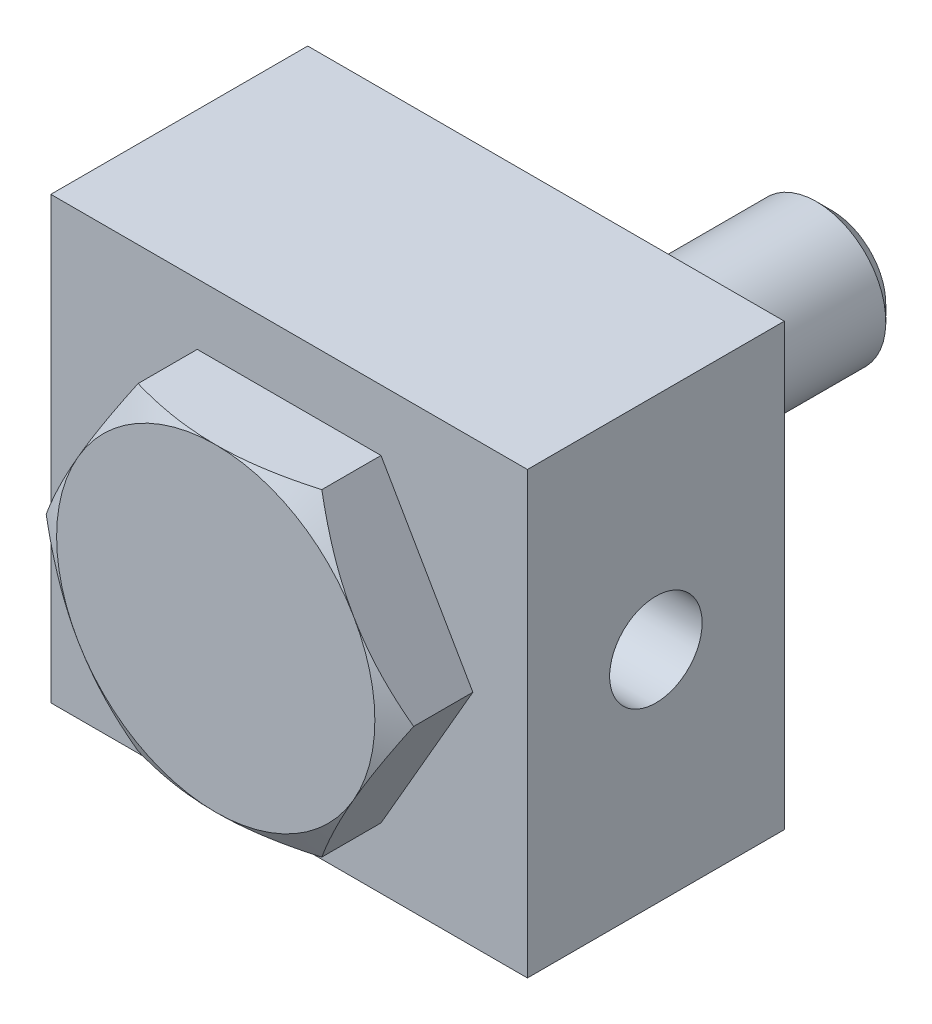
ISO-10303-21;
HEADER;
FILE_DESCRIPTION(('STEP AP214'),'2;1');
FILE_NAME('part.step','',(''),(''),'','','');
FILE_SCHEMA(('AUTOMOTIVE_DESIGN { 1 0 10303 214 1 1 1 1 }'));
ENDSEC;
DATA;
#1=APPLICATION_CONTEXT('core data for automotive mechanical design processes');
#2=APPLICATION_PROTOCOL_DEFINITION('international standard','automotive_design',2000,#1);
#3=PRODUCT_CONTEXT('',#1,'mechanical');
#4=PRODUCT('Part','Part','',(#3));
#5=PRODUCT_RELATED_PRODUCT_CATEGORY('part','',(#4));
#6=PRODUCT_DEFINITION_FORMATION('','',#4);
#7=PRODUCT_DEFINITION_CONTEXT('part definition',#1,'design');
#8=PRODUCT_DEFINITION('design','',#6,#7);
#9=PRODUCT_DEFINITION_SHAPE('','',#8);
#10=(LENGTH_UNIT() NAMED_UNIT(*) SI_UNIT(.MILLI.,.METRE.));
#11=(NAMED_UNIT(*) PLANE_ANGLE_UNIT() SI_UNIT($,.RADIAN.));
#12=(NAMED_UNIT(*) SI_UNIT($,.STERADIAN.) SOLID_ANGLE_UNIT());
#13=UNCERTAINTY_MEASURE_WITH_UNIT(LENGTH_MEASURE(1.E-05),#10,'distance_accuracy_value','');
#14=(GEOMETRIC_REPRESENTATION_CONTEXT(3) GLOBAL_UNCERTAINTY_ASSIGNED_CONTEXT((#13)) GLOBAL_UNIT_ASSIGNED_CONTEXT((#10,
#11,#12)) REPRESENTATION_CONTEXT('',''));
#15=CARTESIAN_POINT('',(0.,0.,0.));
#16=DIRECTION('',(0.,0.,1.));
#17=DIRECTION('',(1.,0.,0.));
#18=AXIS2_PLACEMENT_3D('',#15,#16,#17);
#19=CARTESIAN_POINT('',(-41.7703,41.7703,88.519));
#20=DIRECTION('',(0.,0.,1.));
#21=DIRECTION('',(0.,-1.,0.));
#22=AXIS2_PLACEMENT_3D('',#19,#20,#21);
#23=PLANE('',#22);
#24=CARTESIAN_POINT('',(0.,0.,88.519));
#25=DIRECTION('',(0.,0.,1.));
#26=DIRECTION('',(0.,-1.,0.));
#27=AXIS2_PLACEMENT_3D('',#24,#25,#26);
#28=CIRCLE('',#27,41.3);
#29=CARTESIAN_POINT('',(0.,-41.3,88.519));
#30=VERTEX_POINT('',#29);
#31=CARTESIAN_POINT('',(-35.7668491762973,-20.65,88.519));
#32=VERTEX_POINT('',#31);
#33=EDGE_CURVE('E113',#30,#32,#28,.F.);
#34=ORIENTED_EDGE('',*,*,#33,.F.);
#35=CARTESIAN_POINT('',(35.7668491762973,-20.65,88.519));
#36=VERTEX_POINT('',#35);
#37=EDGE_CURVE('E126',#36,#30,#28,.F.);
#38=ORIENTED_EDGE('',*,*,#37,.F.);
#39=CARTESIAN_POINT('',(35.7668491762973,20.65,88.519));
#40=VERTEX_POINT('',#39);
#41=EDGE_CURVE('E132',#40,#36,#28,.F.);
#42=ORIENTED_EDGE('',*,*,#41,.F.);
#43=CARTESIAN_POINT('',(0.,0.,88.519));
#44=DIRECTION('',(0.,0.,1.));
#45=DIRECTION('',(1.,0.,0.));
#46=AXIS2_PLACEMENT_3D('',#43,#44,#45);
#47=CIRCLE('',#46,41.3);
#48=CARTESIAN_POINT('',(0.,41.3,88.519));
#49=VERTEX_POINT('',#48);
#50=EDGE_CURVE('E364',#40,#49,#47,.T.);
#51=ORIENTED_EDGE('',*,*,#50,.T.);
#52=CARTESIAN_POINT('',(-35.7668491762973,20.65,88.519));
#53=VERTEX_POINT('',#52);
#54=EDGE_CURVE('E537',#53,#49,#28,.F.);
#55=ORIENTED_EDGE('',*,*,#54,.F.);
#56=EDGE_CURVE('E136',#32,#53,#28,.F.);
#57=ORIENTED_EDGE('',*,*,#56,.F.);
#58=EDGE_LOOP('',(#34,#38,#42,#51,#55,#57));
#59=FACE_BOUND('',#58,.T.);
#60=ADVANCED_FACE('F14',(#59),#23,.T.);
#61=CARTESIAN_POINT('',(0.,0.,78.8727471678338));
#62=DIRECTION('',(0.,0.,-1.));
#63=DIRECTION('',(-1.,0.,0.));
#64=AXIS2_PLACEMENT_3D('',#61,#62,#63);
#65=CONICAL_SURFACE('',#64,58.0078000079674,1.0471975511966);
#66=ORIENTED_EDGE('',*,*,#33,.T.);
#67=CARTESIAN_POINT('',(-23.8444506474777,-41.3002,84.8301661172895));
#68=CARTESIAN_POINT('',(-24.3685431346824,-40.3924451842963,85.1327273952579));
#69=CARTESIAN_POINT('',(-24.8946798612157,-39.4811496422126,85.4215586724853));
#70=CARTESIAN_POINT('',(-25.9511722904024,-37.6512510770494,85.967944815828));
#71=CARTESIAN_POINT('',(-26.4815293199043,-36.7326457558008,86.2254893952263));
#72=CARTESIAN_POINT('',(-27.5474986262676,-34.8863327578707,86.7058452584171));
#73=CARTESIAN_POINT('',(-28.0831203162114,-33.958608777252,86.9285735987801));
#74=CARTESIAN_POINT('',(-29.1580627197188,-32.0967539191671,87.3344988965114));
#75=CARTESIAN_POINT('',(-29.6973830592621,-31.1626236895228,87.5176997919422));
#76=CARTESIAN_POINT('',(-30.7659373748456,-29.3118333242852,87.8367936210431));
#77=CARTESIAN_POINT('',(-31.2950920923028,-28.3953104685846,87.973741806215));
#78=CARTESIAN_POINT('',(-32.3558261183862,-26.5580652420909,88.203371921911));
#79=CARTESIAN_POINT('',(-32.887405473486,-25.6373427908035,88.2960530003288));
#80=CARTESIAN_POINT('',(-33.9514570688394,-23.7943513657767,88.4348087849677));
#81=CARTESIAN_POINT('',(-34.4839274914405,-22.8720855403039,88.4809388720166));
#82=CARTESIAN_POINT('',(-35.5493597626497,-21.0267027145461,88.525600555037));
#83=CARTESIAN_POINT('',(-36.0823215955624,-20.1035857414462,88.524133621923));
#84=CARTESIAN_POINT('',(-37.0786961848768,-18.3778143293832,88.476926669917));
#85=CARTESIAN_POINT('',(-37.5421799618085,-17.5750368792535,88.4369431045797));
#86=CARTESIAN_POINT('',(-38.4680421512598,-15.9713965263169,88.3217374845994));
#87=CARTESIAN_POINT('',(-38.9304205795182,-15.1705335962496,88.2465159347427));
#88=CARTESIAN_POINT('',(-39.8538957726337,-13.571027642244,88.0621424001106));
#89=CARTESIAN_POINT('',(-40.3149909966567,-12.7723872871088,87.9529597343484));
#90=CARTESIAN_POINT('',(-41.2349897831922,-11.1789026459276,87.7025797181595));
#91=CARTESIAN_POINT('',(-41.6938933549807,-10.3840583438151,87.5613825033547));
#92=CARTESIAN_POINT('',(-42.6192515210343,-8.78129098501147,87.2457582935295));
#93=CARTESIAN_POINT('',(-43.0856491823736,-7.97346653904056,87.0706665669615));
#94=CARTESIAN_POINT('',(-44.0155899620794,-6.36276186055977,86.6919247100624));
#95=CARTESIAN_POINT('',(-44.4791326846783,-5.55988231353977,86.4882707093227));
#96=CARTESIAN_POINT('',(-45.4022766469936,-3.96095006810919,86.0554861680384));
#97=CARTESIAN_POINT('',(-45.8618837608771,-3.1648871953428,85.8264054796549));
#98=CARTESIAN_POINT('',(-46.7779191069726,-1.57826743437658,85.3450529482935));
#99=CARTESIAN_POINT('',(-47.2343481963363,-0.787709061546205,85.0927876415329));
#100=CARTESIAN_POINT('',(-47.689247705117,0.000199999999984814,84.8301661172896));
#101=B_SPLINE_CURVE_WITH_KNOTS('',3,(#67,#68,#69,#70,#71,#72,#73,#74,#75,#76,#77,#78,#79,#80,
#81,#82,#83,#84,#85,#86,#87,#88,#89,#90,#91,#92,#93,#94,#95,#96,#97,#98,#99,#100),.UNSPECIFIED.,
.F.,.F.,(4,2,2,2,2,2,2,2,2,2,2,2,2,2,2,2,4),(0.,3.27302247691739,6.54711819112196,
9.82889872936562,13.110352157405,16.3108811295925,19.5114717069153,22.7082500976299,
25.9049296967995,28.6877475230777,31.470525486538,34.2558247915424,37.0411122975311,
39.8878840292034,42.7350418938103,45.5767129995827,48.4175854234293),.UNSPECIFIED.);
#102=CARTESIAN_POINT('',(-23.8445661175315,-41.3,84.8302327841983));
#103=VERTEX_POINT('',#102);
#104=EDGE_CURVE('E116',#103,#32,#101,.T.);
#105=ORIENTED_EDGE('',*,*,#104,.F.);
#106=CARTESIAN_POINT('',(-64.0693641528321,-41.3,68.3538193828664));
#107=CARTESIAN_POINT('',(-63.1674107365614,-41.3,68.7914941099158));
#108=CARTESIAN_POINT('',(-62.264398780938,-41.3,69.2269946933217));
#109=CARTESIAN_POINT('',(-60.4560384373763,-41.3,70.0931399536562));
#110=CARTESIAN_POINT('',(-59.5506900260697,-41.3,70.5237845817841));
#111=CARTESIAN_POINT('',(-57.737315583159,-41.3,71.37976755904));
#112=CARTESIAN_POINT('',(-56.8292891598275,-41.3,71.8051050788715));
#113=CARTESIAN_POINT('',(-55.0104615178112,-41.3,72.6498031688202));
#114=CARTESIAN_POINT('',(-54.099660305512,-41.3,73.0691637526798));
#115=CARTESIAN_POINT('',(-52.2700525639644,-41.3,73.9034920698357));
#116=CARTESIAN_POINT('',(-51.3512294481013,-41.3,74.3184234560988));
#117=CARTESIAN_POINT('',(-49.5102220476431,-41.3,75.1407598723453));
#118=CARTESIAN_POINT('',(-48.5880377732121,-41.3,75.5481649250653));
#119=CARTESIAN_POINT('',(-46.7400185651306,-41.3,76.3545246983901));
#120=CARTESIAN_POINT('',(-45.8141837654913,-41.3,76.7534797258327));
#121=CARTESIAN_POINT('',(-43.9584905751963,-41.3,77.5419052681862));
#122=CARTESIAN_POINT('',(-43.0286322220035,-41.3,77.9313758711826));
#123=CARTESIAN_POINT('',(-41.1344932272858,-41.3,78.7120058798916));
#124=CARTESIAN_POINT('',(-40.1700683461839,-41.3,79.102815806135));
#125=CARTESIAN_POINT('',(-38.2360812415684,-41.3,79.8715362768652));
#126=CARTESIAN_POINT('',(-37.2665190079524,-41.3,80.2494467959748));
#127=CARTESIAN_POINT('',(-35.3216763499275,-41.3,80.9906628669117));
#128=CARTESIAN_POINT('',(-34.3463952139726,-41.3,81.3539665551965));
#129=CARTESIAN_POINT('',(-32.3897759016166,-41.3,82.0639044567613));
#130=CARTESIAN_POINT('',(-31.4084377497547,-41.3,82.4105387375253));
#131=CARTESIAN_POINT('',(-29.4412647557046,-41.3,83.0841522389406));
#132=CARTESIAN_POINT('',(-28.455443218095,-41.3,83.4111702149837));
#133=CARTESIAN_POINT('',(-26.4768978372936,-41.3,84.0437404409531));
#134=CARTESIAN_POINT('',(-25.4841738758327,-41.3,84.3492923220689));
#135=CARTESIAN_POINT('',(-23.4917994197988,-41.3,84.9359605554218));
#136=CARTESIAN_POINT('',(-22.4921508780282,-41.3,85.2170835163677));
#137=CARTESIAN_POINT('',(-20.4855307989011,-41.3,85.751821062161));
#138=CARTESIAN_POINT('',(-19.4785595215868,-41.3,86.0054366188));
#139=CARTESIAN_POINT('',(-17.4628765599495,-41.3,86.4804932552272));
#140=CARTESIAN_POINT('',(-16.4542050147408,-41.3,86.7021038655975));
#141=CARTESIAN_POINT('',(-14.4299865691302,-41.3,87.1113979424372));
#142=CARTESIAN_POINT('',(-13.414439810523,-41.3,87.2990821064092));
#143=CARTESIAN_POINT('',(-11.377162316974,-41.3,87.6372091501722));
#144=CARTESIAN_POINT('',(-10.3554317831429,-41.3,87.7876532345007));
#145=CARTESIAN_POINT('',(-8.30681732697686,-41.3,88.048308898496));
#146=CARTESIAN_POINT('',(-7.27993340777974,-41.3,88.1585205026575));
#147=CARTESIAN_POINT('',(-5.23591892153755,-41.3,88.3351296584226));
#148=CARTESIAN_POINT('',(-4.2188365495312,-41.3,88.4020816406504));
#149=CARTESIAN_POINT('',(-2.1827513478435,-41.3,88.4929124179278));
#150=CARTESIAN_POINT('',(-1.16374855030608,-41.3,88.5167919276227));
#151=CARTESIAN_POINT('',(0.874346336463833,-41.3,88.5209153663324));
#152=CARTESIAN_POINT('',(1.8934384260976,-41.3,88.5011590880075));
#153=CARTESIAN_POINT('',(3.92991883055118,-41.3,88.4184720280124));
#154=CARTESIAN_POINT('',(4.94730706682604,-41.3,88.3555393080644));
#155=CARTESIAN_POINT('',(6.67736113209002,-41.3,88.2128124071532));
#156=CARTESIAN_POINT('',(7.39091760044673,-41.3,88.1435535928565));
#157=CARTESIAN_POINT('',(8.81582940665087,-41.3,87.9851608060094));
#158=CARTESIAN_POINT('',(9.52718468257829,-41.3,87.8960262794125));
#159=CARTESIAN_POINT('',(11.657396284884,-41.3,87.6001099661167));
#160=CARTESIAN_POINT('',(13.072362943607,-41.3,87.364818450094));
#161=CARTESIAN_POINT('',(15.8902816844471,-41.3,86.8265351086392));
#162=CARTESIAN_POINT('',(17.2932234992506,-41.3,86.5234904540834));
#163=CARTESIAN_POINT('',(20.0850707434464,-41.3,85.8589608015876));
#164=CARTESIAN_POINT('',(21.4739763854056,-41.3,85.4974766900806));
#165=CARTESIAN_POINT('',(24.2681905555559,-41.3,84.7163388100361));
#166=CARTESIAN_POINT('',(25.6731880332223,-41.3,84.2955805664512));
#167=CARTESIAN_POINT('',(28.4693419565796,-41.3,83.4105802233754));
#168=CARTESIAN_POINT('',(29.8604983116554,-41.3,82.9463378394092));
#169=CARTESIAN_POINT('',(32.6296674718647,-41.3,81.9817397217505));
#170=CARTESIAN_POINT('',(34.0076844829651,-41.3,81.4813960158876));
#171=CARTESIAN_POINT('',(36.0661280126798,-41.3,80.7082102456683));
#172=CARTESIAN_POINT('',(36.7508455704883,-41.3,80.4467032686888));
#173=CARTESIAN_POINT('',(38.1176001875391,-41.3,79.9167638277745));
#174=CARTESIAN_POINT('',(38.7996372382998,-41.3,79.6483313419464));
#175=CARTESIAN_POINT('',(40.3980718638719,-41.3,79.0106346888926));
#176=CARTESIAN_POINT('',(41.3134382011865,-41.3,78.6387862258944));
#177=CARTESIAN_POINT('',(43.1399646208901,-41.3,77.8848826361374));
#178=CARTESIAN_POINT('',(44.0511246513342,-41.3,77.5028273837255));
#179=CARTESIAN_POINT('',(45.8696223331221,-41.3,76.7296224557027));
#180=CARTESIAN_POINT('',(46.7769598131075,-41.3,76.3384723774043));
#181=CARTESIAN_POINT('',(48.5881012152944,-41.3,75.5480693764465));
#182=CARTESIAN_POINT('',(49.4919051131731,-41.3,75.1488163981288));
#183=CARTESIAN_POINT('',(52.1988484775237,-41.3,73.9400545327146));
#184=CARTESIAN_POINT('',(53.9971500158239,-41.3,73.119700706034));
#185=CARTESIAN_POINT('',(57.5828931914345,-41.3,71.4557710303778));
#186=CARTESIAN_POINT('',(59.37033505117,-41.3,70.6121956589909));
#187=CARTESIAN_POINT('',(62.9380543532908,-41.3,68.9051912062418));
#188=CARTESIAN_POINT('',(64.7183220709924,-41.3,68.0417418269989));
#189=CARTESIAN_POINT('',(68.2711988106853,-41.3,66.2992324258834));
#190=CARTESIAN_POINT('',(70.0438078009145,-41.3,65.4201723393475));
#191=CARTESIAN_POINT('',(73.5823142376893,-41.3,63.6491967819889));
#192=CARTESIAN_POINT('',(75.3482124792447,-41.3,62.7572828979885));
#193=CARTESIAN_POINT('',(78.8744727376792,-41.3,60.9625944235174));
#194=CARTESIAN_POINT('',(80.6348347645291,-41.3,60.0598198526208));
#195=CARTESIAN_POINT('',(84.0054836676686,-41.3,58.3200977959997));
#196=CARTESIAN_POINT('',(85.6161465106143,-41.3,57.4838781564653));
#197=CARTESIAN_POINT('',(88.8339886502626,-41.3,55.8047663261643));
#198=CARTESIAN_POINT('',(90.4411679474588,-41.3,54.9618741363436));
#199=CARTESIAN_POINT('',(93.6525266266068,-41.3,53.2702676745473));
#200=CARTESIAN_POINT('',(95.2567059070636,-41.3,52.4215532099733));
#201=CARTESIAN_POINT('',(98.4623765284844,-41.3,50.7190626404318));
#202=CARTESIAN_POINT('',(100.063867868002,-41.3,49.8652865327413));
#203=CARTESIAN_POINT('',(103.260553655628,-41.3,48.1553865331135));
#204=CARTESIAN_POINT('',(104.855753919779,-41.3,47.2992735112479));
#205=CARTESIAN_POINT('',(108.044052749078,-41.3,45.5831423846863));
#206=CARTESIAN_POINT('',(109.637151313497,-41.3,44.7231242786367));
#207=CARTESIAN_POINT('',(112.821389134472,-41.3,42.9996744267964));
#208=CARTESIAN_POINT('',(114.412528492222,-41.3,42.1362428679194));
#209=CARTESIAN_POINT('',(117.593122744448,-41.3,40.4062884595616));
#210=CARTESIAN_POINT('',(119.182577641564,-41.3,39.539765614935));
#211=CARTESIAN_POINT('',(120.771287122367,-41.3,38.6718800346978));
#212=B_SPLINE_CURVE_WITH_KNOTS('',3,(#106,#107,#108,#109,#110,#111,#112,#113,#114,#115,#116,
#117,#118,#119,#120,#121,#122,#123,#124,#125,#126,#127,#128,#129,#130,#131,#132,#133,#134,#135,
#136,#137,#138,#139,#140,#141,#142,#143,#144,#145,#146,#147,#148,#149,#150,#151,#152,#153,#154,
#155,#156,#157,#158,#159,#160,#161,#162,#163,#164,#165,#166,#167,#168,#169,#170,#171,#172,#173,
#174,#175,#176,#177,#178,#179,#180,#181,#182,#183,#184,#185,#186,#187,#188,#189,#190,#191,#192,
#193,#194,#195,#196,#197,#198,#199,#200,#201,#202,#203,#204,#205,#206,#207,#208,#209,#210,#211),
.UNSPECIFIED.,.F.,.F.,(4,2,2,2,2,2,2,2,2,2,2,2,2,2,2,2,2,2,2,2,2,2,2,2,2,2,2,2,2,2,2,2,2,2,2,2,
2,2,2,2,2,2,2,2,2,2,2,2,2,2,2,2,4),(0.,3.00761084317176,6.01525188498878,9.02335716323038,
12.0314555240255,15.0559312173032,18.0803977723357,21.1047543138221,24.129082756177,
27.2507997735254,30.3725229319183,33.4946431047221,36.6167506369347,39.7324716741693,
42.8482462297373,45.963175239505,49.0779941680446,52.1756558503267,55.2732538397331,
58.3707516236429,61.4682475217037,64.5252131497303,67.5821280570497,70.63905748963,
73.6961241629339,75.8465795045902,77.9970947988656,82.2982319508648,86.6027345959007,
90.9071719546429,95.3062764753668,99.7054097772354,104.103084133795,106.301921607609,
108.500766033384,111.464728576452,114.428727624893,117.392858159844,120.357009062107,
126.286516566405,132.215902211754,138.151638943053,144.087400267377,150.022434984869,
155.957459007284,161.401840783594,166.846221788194,172.290783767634,177.735348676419,
183.166580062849,188.597813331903,194.028753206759,199.459684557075),.UNSPECIFIED.);
#213=EDGE_CURVE('E109',#30,#103,#212,.F.);
#214=ORIENTED_EDGE('',*,*,#213,.F.);
#215=EDGE_LOOP('',(#66,#105,#214));
#216=FACE_BOUND('',#215,.T.);
#217=ADVANCED_FACE('F111',(#216),#65,.T.);
#218=CARTESIAN_POINT('',(47.6892477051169,0.000200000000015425,84.8301661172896));
#219=CARTESIAN_POINT('',(47.1651552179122,-0.907554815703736,85.1327273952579));
#220=CARTESIAN_POINT('',(46.6390184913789,-1.8188503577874,85.4215586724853));
#221=CARTESIAN_POINT('',(45.5825260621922,-3.64874892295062,85.967944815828));
#222=CARTESIAN_POINT('',(45.0521690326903,-4.56735424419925,86.2254893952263));
#223=CARTESIAN_POINT('',(43.986199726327,-6.41366724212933,86.7058452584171));
#224=CARTESIAN_POINT('',(43.4505780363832,-7.34139122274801,86.9285735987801));
#225=CARTESIAN_POINT('',(42.3756356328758,-9.2032460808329,87.3344988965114));
#226=CARTESIAN_POINT('',(41.8363152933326,-10.1373763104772,87.5176997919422));
#227=CARTESIAN_POINT('',(40.767760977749,-11.9881666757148,87.8367936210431));
#228=CARTESIAN_POINT('',(40.2386062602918,-12.9046895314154,87.973741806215));
#229=CARTESIAN_POINT('',(39.1778722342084,-14.7419347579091,88.203371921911));
#230=CARTESIAN_POINT('',(38.6462928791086,-15.6626572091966,88.2960530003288));
#231=CARTESIAN_POINT('',(37.5822412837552,-17.5056486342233,88.4348087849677));
#232=CARTESIAN_POINT('',(37.0497708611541,-18.4279144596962,88.4809388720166));
#233=CARTESIAN_POINT('',(35.984338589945,-20.2732972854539,88.525600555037));
#234=CARTESIAN_POINT('',(35.4513767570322,-21.1964142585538,88.524133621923));
#235=CARTESIAN_POINT('',(34.4550021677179,-22.9221856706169,88.476926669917));
#236=CARTESIAN_POINT('',(33.9915183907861,-23.7249631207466,88.4369431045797));
#237=CARTESIAN_POINT('',(33.0656562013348,-25.3286034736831,88.3217374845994));
#238=CARTESIAN_POINT('',(32.6032777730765,-26.1294664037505,88.2465159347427));
#239=CARTESIAN_POINT('',(31.679802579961,-27.728972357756,88.0621424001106));
#240=CARTESIAN_POINT('',(31.218707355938,-28.5276127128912,87.9529597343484));
#241=CARTESIAN_POINT('',(30.2987085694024,-30.1210973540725,87.7025797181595));
#242=CARTESIAN_POINT('',(29.8398049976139,-30.915941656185,87.5613825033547));
#243=CARTESIAN_POINT('',(28.9144468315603,-32.5187090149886,87.2457582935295));
#244=CARTESIAN_POINT('',(28.4480491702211,-33.3265334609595,87.0706665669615));
#245=CARTESIAN_POINT('',(27.5181083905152,-34.9372381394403,86.6919247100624));
#246=CARTESIAN_POINT('',(27.0545656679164,-35.7401176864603,86.4882707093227));
#247=CARTESIAN_POINT('',(26.131421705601,-37.3390499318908,86.0554861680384));
#248=CARTESIAN_POINT('',(25.6718145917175,-38.1351128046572,85.8264054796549));
#249=CARTESIAN_POINT('',(24.7557792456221,-39.7217325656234,85.3450529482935));
#250=CARTESIAN_POINT('',(24.2993501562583,-40.5122909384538,85.0927876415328));
#251=CARTESIAN_POINT('',(23.8444506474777,-41.3002,84.8301661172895));
#252=B_SPLINE_CURVE_WITH_KNOTS('',3,(#218,#219,#220,#221,#222,#223,#224,#225,#226,#227,#228,
#229,#230,#231,#232,#233,#234,#235,#236,#237,#238,#239,#240,#241,#242,#243,#244,#245,#246,#247,
#248,#249,#250,#251),.UNSPECIFIED.,.F.,.F.,(4,2,2,2,2,2,2,2,2,2,2,2,2,2,2,2,4),(0.,
3.27302247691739,6.54711819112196,9.82889872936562,13.110352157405,16.3108811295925,
19.5114717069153,22.7082500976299,25.9049296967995,28.6877475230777,31.470525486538,
34.2558247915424,37.0411122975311,39.8878840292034,42.7350418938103,45.5767129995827,
48.4175854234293),.UNSPECIFIED.);
#253=CARTESIAN_POINT('',(23.8445661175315,-41.3,84.8302327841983));
#254=VERTEX_POINT('',#253);
#255=EDGE_CURVE('E121',#36,#254,#252,.T.);
#256=ORIENTED_EDGE('',*,*,#255,.F.);
#257=ORIENTED_EDGE('',*,*,#37,.T.);
#258=EDGE_CURVE('E120',#254,#30,#212,.F.);
#259=ORIENTED_EDGE('',*,*,#258,.F.);
#260=EDGE_LOOP('',(#256,#257,#259));
#261=FACE_BOUND('',#260,.T.);
#262=ADVANCED_FACE('F127',(#261),#65,.T.);
#263=CARTESIAN_POINT('',(23.8444506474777,41.3002,84.8301661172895));
#264=CARTESIAN_POINT('',(24.3685431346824,40.3924451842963,85.1327273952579));
#265=CARTESIAN_POINT('',(24.8946798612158,39.4811496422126,85.4215586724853));
#266=CARTESIAN_POINT('',(25.9511722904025,37.6512510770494,85.967944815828));
#267=CARTESIAN_POINT('',(26.4815293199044,36.7326457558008,86.2254893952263));
#268=CARTESIAN_POINT('',(27.5474986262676,34.8863327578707,86.7058452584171));
#269=CARTESIAN_POINT('',(28.0831203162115,33.958608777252,86.9285735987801));
#270=CARTESIAN_POINT('',(29.1580627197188,32.0967539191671,87.3344988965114));
#271=CARTESIAN_POINT('',(29.6973830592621,31.1626236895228,87.5176997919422));
#272=CARTESIAN_POINT('',(30.7659373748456,29.3118333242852,87.8367936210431));
#273=CARTESIAN_POINT('',(31.2950920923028,28.3953104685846,87.973741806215));
#274=CARTESIAN_POINT('',(32.3558261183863,26.5580652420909,88.203371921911));
#275=CARTESIAN_POINT('',(32.887405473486,25.6373427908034,88.2960530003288));
#276=CARTESIAN_POINT('',(33.9514570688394,23.7943513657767,88.4348087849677));
#277=CARTESIAN_POINT('',(34.4839274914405,22.8720855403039,88.4809388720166));
#278=CARTESIAN_POINT('',(35.5493597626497,21.0267027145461,88.525600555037));
#279=CARTESIAN_POINT('',(36.0823215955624,20.1035857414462,88.524133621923));
#280=CARTESIAN_POINT('',(37.0786961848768,18.3778143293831,88.476926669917));
#281=CARTESIAN_POINT('',(37.5421799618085,17.5750368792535,88.4369431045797));
#282=CARTESIAN_POINT('',(38.4680421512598,15.9713965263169,88.3217374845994));
#283=CARTESIAN_POINT('',(38.9304205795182,15.1705335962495,88.2465159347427));
#284=CARTESIAN_POINT('',(39.8538957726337,13.571027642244,88.0621424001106));
#285=CARTESIAN_POINT('',(40.3149909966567,12.7723872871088,87.9529597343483));
#286=CARTESIAN_POINT('',(41.2349897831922,11.1789026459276,87.7025797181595));
#287=CARTESIAN_POINT('',(41.6938933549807,10.3840583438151,87.5613825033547));
#288=CARTESIAN_POINT('',(42.6192515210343,8.78129098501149,87.2457582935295));
#289=CARTESIAN_POINT('',(43.0856491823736,7.97346653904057,87.0706665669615));
#290=CARTESIAN_POINT('',(44.0155899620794,6.36276186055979,86.6919247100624));
#291=CARTESIAN_POINT('',(44.4791326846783,5.55988231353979,86.4882707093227));
#292=CARTESIAN_POINT('',(45.4022766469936,3.96095006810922,86.0554861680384));
#293=CARTESIAN_POINT('',(45.8618837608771,3.16488719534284,85.8264054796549));
#294=CARTESIAN_POINT('',(46.7779191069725,1.57826743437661,85.3450529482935));
#295=CARTESIAN_POINT('',(47.2343481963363,0.787709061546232,85.0927876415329));
#296=CARTESIAN_POINT('',(47.6892477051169,-0.000199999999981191,84.8301661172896));
#297=B_SPLINE_CURVE_WITH_KNOTS('',3,(#263,#264,#265,#266,#267,#268,#269,#270,#271,#272,#273,
#274,#275,#276,#277,#278,#279,#280,#281,#282,#283,#284,#285,#286,#287,#288,#289,#290,#291,#292,
#293,#294,#295,#296),.UNSPECIFIED.,.F.,.F.,(4,2,2,2,2,2,2,2,2,2,2,2,2,2,2,2,4),(0.,
3.27302247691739,6.54711819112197,9.82889872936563,13.110352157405,16.3108811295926,
19.5114717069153,22.70825009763,25.9049296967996,28.6877475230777,31.470525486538,
34.2558247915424,37.0411122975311,39.8878840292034,42.7350418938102,45.5767129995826,
48.4175854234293),.UNSPECIFIED.);
#298=CARTESIAN_POINT('',(47.6891322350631,0.,84.8302327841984));
#299=VERTEX_POINT('',#298);
#300=EDGE_CURVE('E202',#40,#299,#297,.T.);
#301=ORIENTED_EDGE('',*,*,#300,.F.);
#302=ORIENTED_EDGE('',*,*,#41,.T.);
#303=EDGE_CURVE('E197',#299,#36,#252,.T.);
#304=ORIENTED_EDGE('',*,*,#303,.F.);
#305=EDGE_LOOP('',(#301,#302,#304));
#306=FACE_BOUND('',#305,.T.);
#307=ADVANCED_FACE('F497',(#306),#65,.T.);
#308=CARTESIAN_POINT('',(-64.0693641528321,41.3,68.3538193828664));
#309=CARTESIAN_POINT('',(-63.1674107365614,41.3,68.7914941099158));
#310=CARTESIAN_POINT('',(-62.264398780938,41.3,69.2269946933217));
#311=CARTESIAN_POINT('',(-60.4560384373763,41.3,70.0931399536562));
#312=CARTESIAN_POINT('',(-59.5506900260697,41.3,70.5237845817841));
#313=CARTESIAN_POINT('',(-57.737315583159,41.3,71.37976755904));
#314=CARTESIAN_POINT('',(-56.8292891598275,41.3,71.8051050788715));
#315=CARTESIAN_POINT('',(-55.0104615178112,41.3,72.6498031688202));
#316=CARTESIAN_POINT('',(-54.099660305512,41.3,73.0691637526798));
#317=CARTESIAN_POINT('',(-52.2700525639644,41.3,73.9034920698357));
#318=CARTESIAN_POINT('',(-51.3512294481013,41.3,74.3184234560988));
#319=CARTESIAN_POINT('',(-49.5102220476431,41.3,75.1407598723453));
#320=CARTESIAN_POINT('',(-48.5880377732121,41.3,75.5481649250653));
#321=CARTESIAN_POINT('',(-46.7400185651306,41.3,76.35452469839));
#322=CARTESIAN_POINT('',(-45.8141837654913,41.3,76.7534797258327));
#323=CARTESIAN_POINT('',(-43.9584905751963,41.3,77.5419052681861));
#324=CARTESIAN_POINT('',(-43.0286322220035,41.3,77.9313758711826));
#325=CARTESIAN_POINT('',(-41.1344932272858,41.3,78.7120058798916));
#326=CARTESIAN_POINT('',(-40.1700683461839,41.3,79.102815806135));
#327=CARTESIAN_POINT('',(-38.2360812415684,41.3,79.8715362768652));
#328=CARTESIAN_POINT('',(-37.2665190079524,41.3,80.2494467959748));
#329=CARTESIAN_POINT('',(-35.3216763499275,41.3,80.9906628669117));
#330=CARTESIAN_POINT('',(-34.3463952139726,41.3,81.3539665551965));
#331=CARTESIAN_POINT('',(-32.3897759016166,41.3,82.0639044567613));
#332=CARTESIAN_POINT('',(-31.4084377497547,41.3,82.4105387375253));
#333=CARTESIAN_POINT('',(-29.4412647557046,41.3,83.0841522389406));
#334=CARTESIAN_POINT('',(-28.455443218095,41.3,83.4111702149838));
#335=CARTESIAN_POINT('',(-26.4768978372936,41.3,84.0437404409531));
#336=CARTESIAN_POINT('',(-25.4841738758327,41.3,84.3492923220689));
#337=CARTESIAN_POINT('',(-23.4917994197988,41.3,84.9359605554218));
#338=CARTESIAN_POINT('',(-22.4921508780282,41.3,85.2170835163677));
#339=CARTESIAN_POINT('',(-20.4855307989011,41.3,85.751821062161));
#340=CARTESIAN_POINT('',(-19.4785595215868,41.3,86.0054366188));
#341=CARTESIAN_POINT('',(-17.4628765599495,41.3,86.4804932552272));
#342=CARTESIAN_POINT('',(-16.4542050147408,41.3,86.7021038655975));
#343=CARTESIAN_POINT('',(-14.4299865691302,41.3,87.1113979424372));
#344=CARTESIAN_POINT('',(-13.414439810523,41.3,87.2990821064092));
#345=CARTESIAN_POINT('',(-11.377162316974,41.3,87.6372091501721));
#346=CARTESIAN_POINT('',(-10.355431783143,41.3,87.7876532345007));
#347=CARTESIAN_POINT('',(-8.30681732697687,41.3,88.048308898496));
#348=CARTESIAN_POINT('',(-7.27993340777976,41.3,88.1585205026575));
#349=CARTESIAN_POINT('',(-5.23591892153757,41.3,88.3351296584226));
#350=CARTESIAN_POINT('',(-4.21883654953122,41.3,88.4020816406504));
#351=CARTESIAN_POINT('',(-2.18275134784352,41.3,88.4929124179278));
#352=CARTESIAN_POINT('',(-1.16374855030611,41.3,88.5167919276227));
#353=CARTESIAN_POINT('',(0.874346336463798,41.3,88.5209153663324));
#354=CARTESIAN_POINT('',(1.89343842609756,41.3,88.5011590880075));
#355=CARTESIAN_POINT('',(3.92991883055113,41.3,88.4184720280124));
#356=CARTESIAN_POINT('',(4.947307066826,41.3,88.3555393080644));
#357=CARTESIAN_POINT('',(6.67736113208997,41.3,88.2128124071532));
#358=CARTESIAN_POINT('',(7.39091760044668,41.3,88.1435535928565));
#359=CARTESIAN_POINT('',(8.81582940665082,41.3,87.9851608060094));
#360=CARTESIAN_POINT('',(9.52718468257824,41.3,87.8960262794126));
#361=CARTESIAN_POINT('',(11.6573962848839,41.3,87.6001099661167));
#362=CARTESIAN_POINT('',(13.072362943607,41.3,87.364818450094));
#363=CARTESIAN_POINT('',(15.890281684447,41.3,86.8265351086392));
#364=CARTESIAN_POINT('',(17.2932234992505,41.3,86.5234904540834));
#365=CARTESIAN_POINT('',(20.0850707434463,41.3,85.8589608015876));
#366=CARTESIAN_POINT('',(21.4739763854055,41.3,85.4974766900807));
#367=CARTESIAN_POINT('',(24.2681905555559,41.3,84.7163388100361));
#368=CARTESIAN_POINT('',(25.6731880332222,41.3,84.2955805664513));
#369=CARTESIAN_POINT('',(28.4693419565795,41.3,83.4105802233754));
#370=CARTESIAN_POINT('',(29.8604983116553,41.3,82.9463378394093));
#371=CARTESIAN_POINT('',(32.6296674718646,41.3,81.9817397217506));
#372=CARTESIAN_POINT('',(34.007684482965,41.3,81.4813960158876));
#373=CARTESIAN_POINT('',(36.0661280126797,41.3,80.7082102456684));
#374=CARTESIAN_POINT('',(36.7508455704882,41.3,80.4467032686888));
#375=CARTESIAN_POINT('',(38.117600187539,41.3,79.9167638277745));
#376=CARTESIAN_POINT('',(38.7996372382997,41.3,79.6483313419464));
#377=CARTESIAN_POINT('',(40.3980718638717,41.3,79.0106346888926));
#378=CARTESIAN_POINT('',(41.3134382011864,41.3,78.6387862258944));
#379=CARTESIAN_POINT('',(43.13996462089,41.3,77.8848826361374));
#380=CARTESIAN_POINT('',(44.0511246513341,41.3,77.5028273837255));
#381=CARTESIAN_POINT('',(45.869622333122,41.3,76.7296224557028));
#382=CARTESIAN_POINT('',(46.7769598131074,41.3,76.3384723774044));
#383=CARTESIAN_POINT('',(48.5881012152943,41.3,75.5480693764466));
#384=CARTESIAN_POINT('',(49.491905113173,41.3,75.1488163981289));
#385=CARTESIAN_POINT('',(52.1988484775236,41.3,73.9400545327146));
#386=CARTESIAN_POINT('',(53.9971500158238,41.3,73.119700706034));
#387=CARTESIAN_POINT('',(57.5828931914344,41.3,71.4557710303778));
#388=CARTESIAN_POINT('',(59.3703350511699,41.3,70.612195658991));
#389=CARTESIAN_POINT('',(62.9380543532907,41.3,68.9051912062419));
#390=CARTESIAN_POINT('',(64.7183220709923,41.3,68.0417418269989));
#391=CARTESIAN_POINT('',(68.2711988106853,41.3,66.2992324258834));
#392=CARTESIAN_POINT('',(70.0438078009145,41.3,65.4201723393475));
#393=CARTESIAN_POINT('',(73.5823142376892,41.3,63.649196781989));
#394=CARTESIAN_POINT('',(75.3482124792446,41.3,62.7572828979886));
#395=CARTESIAN_POINT('',(78.8744727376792,41.3,60.9625944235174));
#396=CARTESIAN_POINT('',(80.634834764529,41.3,60.0598198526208));
#397=CARTESIAN_POINT('',(84.0054836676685,41.3,58.3200977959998));
#398=CARTESIAN_POINT('',(85.6161465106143,41.3,57.4838781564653));
#399=CARTESIAN_POINT('',(88.8339886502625,41.3,55.8047663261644));
#400=CARTESIAN_POINT('',(90.4411679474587,41.3,54.9618741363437));
#401=CARTESIAN_POINT('',(93.6525266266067,41.3,53.2702676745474));
#402=CARTESIAN_POINT('',(95.2567059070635,41.3,52.4215532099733));
#403=CARTESIAN_POINT('',(98.4623765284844,41.3,50.7190626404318));
#404=CARTESIAN_POINT('',(100.063867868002,41.3,49.8652865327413));
#405=CARTESIAN_POINT('',(103.260553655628,41.3,48.1553865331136));
#406=CARTESIAN_POINT('',(104.855753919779,41.3,47.299273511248));
#407=CARTESIAN_POINT('',(108.044052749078,41.3,45.5831423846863));
#408=CARTESIAN_POINT('',(109.637151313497,41.3,44.7231242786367));
#409=CARTESIAN_POINT('',(112.821389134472,41.3,42.9996744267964));
#410=CARTESIAN_POINT('',(114.412528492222,41.3,42.1362428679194));
#411=CARTESIAN_POINT('',(117.593122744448,41.3,40.4062884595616));
#412=CARTESIAN_POINT('',(119.182577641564,41.3,39.539765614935));
#413=CARTESIAN_POINT('',(120.771287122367,41.3,38.6718800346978));
#414=B_SPLINE_CURVE_WITH_KNOTS('',3,(#308,#309,#310,#311,#312,#313,#314,#315,#316,#317,#318,
#319,#320,#321,#322,#323,#324,#325,#326,#327,#328,#329,#330,#331,#332,#333,#334,#335,#336,#337,
#338,#339,#340,#341,#342,#343,#344,#345,#346,#347,#348,#349,#350,#351,#352,#353,#354,#355,#356,
#357,#358,#359,#360,#361,#362,#363,#364,#365,#366,#367,#368,#369,#370,#371,#372,#373,#374,#375,
#376,#377,#378,#379,#380,#381,#382,#383,#384,#385,#386,#387,#388,#389,#390,#391,#392,#393,#394,
#395,#396,#397,#398,#399,#400,#401,#402,#403,#404,#405,#406,#407,#408,#409,#410,#411,#412,#413),
.UNSPECIFIED.,.F.,.F.,(4,2,2,2,2,2,2,2,2,2,2,2,2,2,2,2,2,2,2,2,2,2,2,2,2,2,2,2,2,2,2,2,2,2,2,2,
2,2,2,2,2,2,2,2,2,2,2,2,2,2,2,2,4),(0.,3.00761084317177,6.01525188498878,9.02335716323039,
12.0314555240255,15.0559312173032,18.0803977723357,21.1047543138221,24.129082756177,
27.2507997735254,30.3725229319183,33.4946431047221,36.6167506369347,39.7324716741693,
42.8482462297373,45.9631752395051,49.0779941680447,52.1756558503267,55.2732538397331,
58.3707516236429,61.4682475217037,64.5252131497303,67.5821280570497,70.63905748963,
73.6961241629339,75.8465795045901,77.9970947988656,82.2982319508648,86.6027345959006,
90.9071719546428,95.3062764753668,99.7054097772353,104.103084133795,106.301921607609,
108.500766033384,111.464728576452,114.428727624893,117.392858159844,120.357009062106,
126.286516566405,132.215902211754,138.151638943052,144.087400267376,150.022434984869,
155.957459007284,161.401840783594,166.846221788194,172.290783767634,177.735348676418,
183.166580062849,188.597813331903,194.028753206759,199.459684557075),.UNSPECIFIED.);
#415=CARTESIAN_POINT('',(23.8445661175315,41.3,84.8302327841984));
#416=VERTEX_POINT('',#415);
#417=EDGE_CURVE('E340',#49,#416,#414,.T.);
#418=ORIENTED_EDGE('',*,*,#417,.F.);
#419=ORIENTED_EDGE('',*,*,#50,.F.);
#420=EDGE_CURVE('E191',#416,#40,#297,.T.);
#421=ORIENTED_EDGE('',*,*,#420,.F.);
#422=EDGE_LOOP('',(#418,#419,#421));
#423=FACE_BOUND('',#422,.T.);
#424=ADVANCED_FACE('F503',(#423),#65,.T.);
#425=ORIENTED_EDGE('',*,*,#54,.T.);
#426=CARTESIAN_POINT('',(-23.8445661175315,41.3,84.8302327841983));
#427=VERTEX_POINT('',#426);
#428=EDGE_CURVE('E363',#427,#49,#414,.T.);
#429=ORIENTED_EDGE('',*,*,#428,.F.);
#430=CARTESIAN_POINT('',(-47.689247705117,-0.00020000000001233,84.8301661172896));
#431=CARTESIAN_POINT('',(-47.1651552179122,0.907554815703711,85.1327273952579));
#432=CARTESIAN_POINT('',(-46.6390184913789,1.81885035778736,85.4215586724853));
#433=CARTESIAN_POINT('',(-45.5825260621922,3.64874892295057,85.967944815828));
#434=CARTESIAN_POINT('',(-45.0521690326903,4.56735424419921,86.2254893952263));
#435=CARTESIAN_POINT('',(-43.9861997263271,6.41366724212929,86.7058452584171));
#436=CARTESIAN_POINT('',(-43.4505780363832,7.34139122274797,86.9285735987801));
#437=CARTESIAN_POINT('',(-42.3756356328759,9.20324608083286,87.3344988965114));
#438=CARTESIAN_POINT('',(-41.8363152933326,10.1373763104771,87.5176997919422));
#439=CARTESIAN_POINT('',(-40.7677609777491,11.9881666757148,87.8367936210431));
#440=CARTESIAN_POINT('',(-40.2386062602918,12.9046895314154,87.973741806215));
#441=CARTESIAN_POINT('',(-39.1778722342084,14.7419347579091,88.203371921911));
#442=CARTESIAN_POINT('',(-38.6462928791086,15.6626572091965,88.2960530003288));
#443=CARTESIAN_POINT('',(-37.5822412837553,17.5056486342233,88.4348087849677));
#444=CARTESIAN_POINT('',(-37.0497708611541,18.4279144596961,88.4809388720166));
#445=CARTESIAN_POINT('',(-35.984338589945,20.2732972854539,88.525600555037));
#446=CARTESIAN_POINT('',(-35.4513767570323,21.1964142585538,88.524133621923));
#447=CARTESIAN_POINT('',(-34.4550021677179,22.9221856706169,88.476926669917));
#448=CARTESIAN_POINT('',(-33.9915183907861,23.7249631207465,88.4369431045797));
#449=CARTESIAN_POINT('',(-33.0656562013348,25.3286034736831,88.3217374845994));
#450=CARTESIAN_POINT('',(-32.6032777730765,26.1294664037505,88.2465159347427));
#451=CARTESIAN_POINT('',(-31.679802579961,27.728972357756,88.0621424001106));
#452=CARTESIAN_POINT('',(-31.218707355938,28.5276127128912,87.9529597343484));
#453=CARTESIAN_POINT('',(-30.2987085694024,30.1210973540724,87.7025797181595));
#454=CARTESIAN_POINT('',(-29.8398049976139,30.9159416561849,87.5613825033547));
#455=CARTESIAN_POINT('',(-28.9144468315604,32.5187090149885,87.2457582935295));
#456=CARTESIAN_POINT('',(-28.4480491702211,33.3265334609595,87.0706665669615));
#457=CARTESIAN_POINT('',(-27.5181083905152,34.9372381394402,86.6919247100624));
#458=CARTESIAN_POINT('',(-27.0545656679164,35.7401176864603,86.4882707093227));
#459=CARTESIAN_POINT('',(-26.131421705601,37.3390499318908,86.0554861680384));
#460=CARTESIAN_POINT('',(-25.6718145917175,38.1351128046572,85.8264054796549));
#461=CARTESIAN_POINT('',(-24.7557792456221,39.7217325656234,85.3450529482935));
#462=CARTESIAN_POINT('',(-24.2993501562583,40.5122909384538,85.0927876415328));
#463=CARTESIAN_POINT('',(-23.8444506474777,41.3002,84.8301661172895));
#464=B_SPLINE_CURVE_WITH_KNOTS('',3,(#430,#431,#432,#433,#434,#435,#436,#437,#438,#439,#440,
#441,#442,#443,#444,#445,#446,#447,#448,#449,#450,#451,#452,#453,#454,#455,#456,#457,#458,#459,
#460,#461,#462,#463),.UNSPECIFIED.,.F.,.F.,(4,2,2,2,2,2,2,2,2,2,2,2,2,2,2,2,4),(0.,
3.27302247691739,6.54711819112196,9.82889872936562,13.110352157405,16.3108811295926,
19.5114717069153,22.7082500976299,25.9049296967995,28.6877475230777,31.470525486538,
34.2558247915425,37.0411122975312,39.8878840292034,42.7350418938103,45.5767129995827,
48.4175854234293),.UNSPECIFIED.);
#465=EDGE_CURVE('E37',#53,#427,#464,.T.);
#466=ORIENTED_EDGE('',*,*,#465,.F.);
#467=EDGE_LOOP('',(#425,#429,#466));
#468=FACE_BOUND('',#467,.T.);
#469=ADVANCED_FACE('F496',(#468),#65,.T.);
#470=ORIENTED_EDGE('',*,*,#56,.T.);
#471=CARTESIAN_POINT('',(-47.6891322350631,0.,84.8302327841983));
#472=VERTEX_POINT('',#471);
#473=EDGE_CURVE('E190',#472,#53,#464,.T.);
#474=ORIENTED_EDGE('',*,*,#473,.F.);
#475=EDGE_CURVE('E29',#32,#472,#101,.T.);
#476=ORIENTED_EDGE('',*,*,#475,.F.);
#477=EDGE_LOOP('',(#470,#474,#476));
#478=FACE_BOUND('',#477,.T.);
#479=ADVANCED_FACE('F173',(#478),#65,.T.);
#480=CARTESIAN_POINT('',(-47.6891322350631,0.,214.692584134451));
#481=DIRECTION('',(0.866025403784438,0.5,0.));
#482=DIRECTION('',(-0.5,0.866025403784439,0.));
#483=AXIS2_PLACEMENT_3D('',#480,#481,#482);
#484=PLANE('',#483);
#485=DIRECTION('',(0.,0.,-1.));
#486=VECTOR('',#485,1.);
#487=CARTESIAN_POINT('',(-23.8445661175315,-41.3,214.692584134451));
#488=LINE('',#487,#486);
#489=CARTESIAN_POINT('',(-23.8445661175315,-41.3,69.469));
#490=VERTEX_POINT('',#489);
#491=EDGE_CURVE('E208',#103,#490,#488,.T.);
#492=ORIENTED_EDGE('',*,*,#491,.F.);
#493=ORIENTED_EDGE('',*,*,#104,.T.);
#494=ORIENTED_EDGE('',*,*,#475,.T.);
#495=DIRECTION('',(0.,0.,-1.));
#496=VECTOR('',#495,1.);
#497=CARTESIAN_POINT('',(-47.6891322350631,0.,214.692584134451));
#498=LINE('',#497,#496);
#499=CARTESIAN_POINT('',(-47.6891322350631,0.,69.469));
#500=VERTEX_POINT('',#499);
#501=EDGE_CURVE('E215',#472,#500,#498,.T.);
#502=ORIENTED_EDGE('',*,*,#501,.T.);
#503=DIRECTION('',(0.5,-0.866025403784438,0.));
#504=VECTOR('',#503,1.);
#505=CARTESIAN_POINT('',(-47.6891322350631,0.,69.469));
#506=LINE('',#505,#504);
#507=EDGE_CURVE('E210',#500,#490,#506,.T.);
#508=ORIENTED_EDGE('',*,*,#507,.T.);
#509=EDGE_LOOP('',(#492,#493,#494,#502,#508));
#510=FACE_BOUND('',#509,.T.);
#511=ADVANCED_FACE('F167',(#510),#484,.F.);
#512=CARTESIAN_POINT('',(-23.8445661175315,-41.3,214.692584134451));
#513=DIRECTION('',(0.,1.,0.));
#514=DIRECTION('',(0.,0.,1.));
#515=AXIS2_PLACEMENT_3D('',#512,#513,#514);
#516=PLANE('',#515);
#517=DIRECTION('',(0.,0.,-1.));
#518=VECTOR('',#517,1.);
#519=CARTESIAN_POINT('',(23.8445661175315,-41.3,214.692584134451));
#520=LINE('',#519,#518);
#521=CARTESIAN_POINT('',(23.8445661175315,-41.3,69.469));
#522=VERTEX_POINT('',#521);
#523=EDGE_CURVE('E140',#254,#522,#520,.T.);
#524=ORIENTED_EDGE('',*,*,#523,.F.);
#525=ORIENTED_EDGE('',*,*,#258,.T.);
#526=ORIENTED_EDGE('',*,*,#213,.T.);
#527=ORIENTED_EDGE('',*,*,#491,.T.);
#528=DIRECTION('',(1.,0.,0.));
#529=VECTOR('',#528,1.);
#530=CARTESIAN_POINT('',(-23.8445661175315,-41.3,69.469));
#531=LINE('',#530,#529);
#532=EDGE_CURVE('E212',#490,#522,#531,.T.);
#533=ORIENTED_EDGE('',*,*,#532,.T.);
#534=EDGE_LOOP('',(#524,#525,#526,#527,#533));
#535=FACE_BOUND('',#534,.T.);
#536=ADVANCED_FACE('F138',(#535),#516,.F.);
#537=CARTESIAN_POINT('',(23.8445661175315,-41.3,214.692584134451));
#538=DIRECTION('',(-0.866025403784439,0.5,0.));
#539=DIRECTION('',(-0.5,-0.866025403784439,0.));
#540=AXIS2_PLACEMENT_3D('',#537,#538,#539);
#541=PLANE('',#540);
#542=DIRECTION('',(0.,0.,-1.));
#543=VECTOR('',#542,1.);
#544=CARTESIAN_POINT('',(47.6891322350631,0.,214.692584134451));
#545=LINE('',#544,#543);
#546=CARTESIAN_POINT('',(47.6891322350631,0.,69.469));
#547=VERTEX_POINT('',#546);
#548=EDGE_CURVE('E222',#299,#547,#545,.T.);
#549=ORIENTED_EDGE('',*,*,#548,.F.);
#550=ORIENTED_EDGE('',*,*,#303,.T.);
#551=ORIENTED_EDGE('',*,*,#255,.T.);
#552=ORIENTED_EDGE('',*,*,#523,.T.);
#553=DIRECTION('',(0.5,0.866025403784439,0.));
#554=VECTOR('',#553,1.);
#555=CARTESIAN_POINT('',(23.8445661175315,-41.3,69.469));
#556=LINE('',#555,#554);
#557=EDGE_CURVE('E221',#522,#547,#556,.T.);
#558=ORIENTED_EDGE('',*,*,#557,.T.);
#559=EDGE_LOOP('',(#549,#550,#551,#552,#558));
#560=FACE_BOUND('',#559,.T.);
#561=ADVANCED_FACE('F166',(#560),#541,.F.);
#562=CARTESIAN_POINT('',(47.6891322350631,0.,214.692584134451));
#563=DIRECTION('',(-0.866025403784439,-0.5,0.));
#564=DIRECTION('',(0.5,-0.866025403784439,0.));
#565=AXIS2_PLACEMENT_3D('',#562,#563,#564);
#566=PLANE('',#565);
#567=DIRECTION('',(0.,0.,-1.));
#568=VECTOR('',#567,1.);
#569=CARTESIAN_POINT('',(23.8445661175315,41.3,214.692584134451));
#570=LINE('',#569,#568);
#571=CARTESIAN_POINT('',(23.8445661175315,41.3,69.469));
#572=VERTEX_POINT('',#571);
#573=EDGE_CURVE('E225',#416,#572,#570,.T.);
#574=ORIENTED_EDGE('',*,*,#573,.F.);
#575=ORIENTED_EDGE('',*,*,#420,.T.);
#576=ORIENTED_EDGE('',*,*,#300,.T.);
#577=ORIENTED_EDGE('',*,*,#548,.T.);
#578=DIRECTION('',(-0.5,0.866025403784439,0.));
#579=VECTOR('',#578,1.);
#580=CARTESIAN_POINT('',(47.6891322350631,0.,69.469));
#581=LINE('',#580,#579);
#582=EDGE_CURVE('E224',#547,#572,#581,.T.);
#583=ORIENTED_EDGE('',*,*,#582,.T.);
#584=EDGE_LOOP('',(#574,#575,#576,#577,#583));
#585=FACE_BOUND('',#584,.T.);
#586=ADVANCED_FACE('F343',(#585),#566,.F.);
#587=CARTESIAN_POINT('',(23.8445661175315,41.3,214.692584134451));
#588=DIRECTION('',(0.,-1.,0.));
#589=DIRECTION('',(0.,0.,-1.));
#590=AXIS2_PLACEMENT_3D('',#587,#588,#589);
#591=PLANE('',#590);
#592=DIRECTION('',(0.,0.,-1.));
#593=VECTOR('',#592,1.);
#594=CARTESIAN_POINT('',(-23.8445661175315,41.3,214.692584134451));
#595=LINE('',#594,#593);
#596=CARTESIAN_POINT('',(-23.8445661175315,41.3,69.469));
#597=VERTEX_POINT('',#596);
#598=EDGE_CURVE('E141',#427,#597,#595,.T.);
#599=ORIENTED_EDGE('',*,*,#598,.F.);
#600=ORIENTED_EDGE('',*,*,#428,.T.);
#601=ORIENTED_EDGE('',*,*,#417,.T.);
#602=ORIENTED_EDGE('',*,*,#573,.T.);
#603=DIRECTION('',(-1.,0.,0.));
#604=VECTOR('',#603,1.);
#605=CARTESIAN_POINT('',(23.8445661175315,41.3,69.469));
#606=LINE('',#605,#604);
#607=EDGE_CURVE('E158',#572,#597,#606,.T.);
#608=ORIENTED_EDGE('',*,*,#607,.T.);
#609=EDGE_LOOP('',(#599,#600,#601,#602,#608));
#610=FACE_BOUND('',#609,.T.);
#611=ADVANCED_FACE('F180',(#610),#591,.F.);
#612=CARTESIAN_POINT('',(-23.8445661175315,41.3,214.692584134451));
#613=DIRECTION('',(0.866025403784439,-0.5,0.));
#614=DIRECTION('',(0.5,0.866025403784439,0.));
#615=AXIS2_PLACEMENT_3D('',#612,#613,#614);
#616=PLANE('',#615);
#617=ORIENTED_EDGE('',*,*,#501,.F.);
#618=ORIENTED_EDGE('',*,*,#473,.T.);
#619=ORIENTED_EDGE('',*,*,#465,.T.);
#620=ORIENTED_EDGE('',*,*,#598,.T.);
#621=DIRECTION('',(-0.5,-0.866025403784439,0.));
#622=VECTOR('',#621,1.);
#623=CARTESIAN_POINT('',(-23.8445661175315,41.3,69.469));
#624=LINE('',#623,#622);
#625=EDGE_CURVE('E142',#597,#500,#624,.T.);
#626=ORIENTED_EDGE('',*,*,#625,.T.);
#627=EDGE_LOOP('',(#617,#618,#619,#620,#626));
#628=FACE_BOUND('',#627,.T.);
#629=ADVANCED_FACE('F175',(#628),#616,.F.);
#630=CARTESIAN_POINT('',(-61.849,-57.15,69.469));
#631=DIRECTION('',(0.,0.,-1.));
#632=DIRECTION('',(0.,1.,0.));
#633=AXIS2_PLACEMENT_3D('',#630,#631,#632);
#634=PLANE('',#633);
#635=DIRECTION('',(0.,-1.,0.));
#636=VECTOR('',#635,1.);
#637=CARTESIAN_POINT('',(-61.849,0.,69.469));
#638=LINE('',#637,#636);
#639=CARTESIAN_POINT('',(-61.849,57.15,69.469));
#640=VERTEX_POINT('',#639);
#641=CARTESIAN_POINT('',(-61.849,-57.15,69.469));
#642=VERTEX_POINT('',#641);
#643=EDGE_CURVE('E133',#640,#642,#638,.T.);
#644=ORIENTED_EDGE('',*,*,#643,.T.);
#645=DIRECTION('',(-1.,0.,0.));
#646=VECTOR('',#645,1.);
#647=CARTESIAN_POINT('',(0.,-57.15,69.469));
#648=LINE('',#647,#646);
#649=CARTESIAN_POINT('',(61.849,-57.15,69.469));
#650=VERTEX_POINT('',#649);
#651=EDGE_CURVE('E245',#650,#642,#648,.T.);
#652=ORIENTED_EDGE('',*,*,#651,.F.);
#653=DIRECTION('',(0.,-1.,0.));
#654=VECTOR('',#653,1.);
#655=CARTESIAN_POINT('',(61.849,0.,69.469));
#656=LINE('',#655,#654);
#657=CARTESIAN_POINT('',(61.849,57.15,69.469));
#658=VERTEX_POINT('',#657);
#659=EDGE_CURVE('E247',#658,#650,#656,.T.);
#660=ORIENTED_EDGE('',*,*,#659,.F.);
#661=DIRECTION('',(1.,0.,0.));
#662=VECTOR('',#661,1.);
#663=CARTESIAN_POINT('',(0.,57.15,69.469));
#664=LINE('',#663,#662);
#665=EDGE_CURVE('E249',#640,#658,#664,.T.);
#666=ORIENTED_EDGE('',*,*,#665,.F.);
#667=EDGE_LOOP('',(#644,#652,#660,#666));
#668=FACE_BOUND('',#667,.T.);
#669=ORIENTED_EDGE('',*,*,#625,.F.);
#670=ORIENTED_EDGE('',*,*,#607,.F.);
#671=ORIENTED_EDGE('',*,*,#582,.F.);
#672=ORIENTED_EDGE('',*,*,#557,.F.);
#673=ORIENTED_EDGE('',*,*,#532,.F.);
#674=ORIENTED_EDGE('',*,*,#507,.F.);
#675=EDGE_LOOP('',(#669,#670,#671,#672,#673,#674));
#676=FACE_BOUND('',#675,.T.);
#677=ADVANCED_FACE('F179',(#668,#676),#634,.F.);
#678=CARTESIAN_POINT('',(61.849,-57.15,2.794));
#679=DIRECTION('',(-1.,0.,0.));
#680=DIRECTION('',(0.,0.,1.));
#681=AXIS2_PLACEMENT_3D('',#678,#679,#680);
#682=PLANE('',#681);
#683=CARTESIAN_POINT('',(61.849,0.,36.1315));
#684=DIRECTION('',(1.,0.,0.));
#685=DIRECTION('',(0.,0.,-1.));
#686=AXIS2_PLACEMENT_3D('',#683,#684,#685);
#687=CIRCLE('',#686,12.);
#688=CARTESIAN_POINT('',(61.849,0.,24.1315));
#689=VERTEX_POINT('',#688);
#690=EDGE_CURVE('E370',#689,#689,#687,.T.);
#691=ORIENTED_EDGE('',*,*,#690,.F.);
#692=EDGE_LOOP('',(#691));
#693=FACE_BOUND('',#692,.T.);
#694=ORIENTED_EDGE('',*,*,#659,.T.);
#695=DIRECTION('',(0.,0.,-1.));
#696=VECTOR('',#695,1.);
#697=CARTESIAN_POINT('',(61.849,-57.15,36.1315));
#698=LINE('',#697,#696);
#699=CARTESIAN_POINT('',(61.849,-57.15,2.794));
#700=VERTEX_POINT('',#699);
#701=EDGE_CURVE('E233',#650,#700,#698,.T.);
#702=ORIENTED_EDGE('',*,*,#701,.T.);
#703=DIRECTION('',(0.,-1.,0.));
#704=VECTOR('',#703,1.);
#705=CARTESIAN_POINT('',(61.849,0.,2.794));
#706=LINE('',#705,#704);
#707=CARTESIAN_POINT('',(61.849,57.15,2.794));
#708=VERTEX_POINT('',#707);
#709=EDGE_CURVE('E257',#708,#700,#706,.T.);
#710=ORIENTED_EDGE('',*,*,#709,.F.);
#711=DIRECTION('',(0.,0.,1.));
#712=VECTOR('',#711,1.);
#713=CARTESIAN_POINT('',(61.849,57.15,36.1315));
#714=LINE('',#713,#712);
#715=EDGE_CURVE('E251',#708,#658,#714,.T.);
#716=ORIENTED_EDGE('',*,*,#715,.T.);
#717=EDGE_LOOP('',(#694,#702,#710,#716));
#718=FACE_BOUND('',#717,.T.);
#719=ADVANCED_FACE('F289',(#693,#718),#682,.F.);
#720=CARTESIAN_POINT('',(-61.849,57.15,69.469));
#721=DIRECTION('',(0.,-1.,0.));
#722=DIRECTION('',(0.,0.,-1.));
#723=AXIS2_PLACEMENT_3D('',#720,#721,#722);
#724=PLANE('',#723);
#725=ORIENTED_EDGE('',*,*,#715,.F.);
#726=DIRECTION('',(1.,0.,0.));
#727=VECTOR('',#726,1.);
#728=CARTESIAN_POINT('',(0.,57.15,2.794));
#729=LINE('',#728,#727);
#730=CARTESIAN_POINT('',(-61.849,57.15,2.794));
#731=VERTEX_POINT('',#730);
#732=EDGE_CURVE('E254',#731,#708,#729,.T.);
#733=ORIENTED_EDGE('',*,*,#732,.F.);
#734=DIRECTION('',(0.,0.,1.));
#735=VECTOR('',#734,1.);
#736=CARTESIAN_POINT('',(-61.849,57.15,36.1315));
#737=LINE('',#736,#735);
#738=EDGE_CURVE('E236',#731,#640,#737,.T.);
#739=ORIENTED_EDGE('',*,*,#738,.T.);
#740=ORIENTED_EDGE('',*,*,#665,.T.);
#741=EDGE_LOOP('',(#725,#733,#739,#740));
#742=FACE_BOUND('',#741,.T.);
#743=ADVANCED_FACE('F292',(#742),#724,.F.);
#744=CARTESIAN_POINT('',(-61.849,-57.15,69.469));
#745=DIRECTION('',(1.,0.,0.));
#746=DIRECTION('',(0.,0.,-1.));
#747=AXIS2_PLACEMENT_3D('',#744,#745,#746);
#748=PLANE('',#747);
#749=CARTESIAN_POINT('',(-61.849,0.,36.1315));
#750=DIRECTION('',(1.,0.,0.));
#751=DIRECTION('',(0.,0.,-1.));
#752=AXIS2_PLACEMENT_3D('',#749,#750,#751);
#753=CIRCLE('',#752,12.);
#754=CARTESIAN_POINT('',(-61.849,0.,24.1315));
#755=VERTEX_POINT('',#754);
#756=EDGE_CURVE('E316',#755,#755,#753,.T.);
#757=ORIENTED_EDGE('',*,*,#756,.T.);
#758=EDGE_LOOP('',(#757));
#759=FACE_BOUND('',#758,.T.);
#760=ORIENTED_EDGE('',*,*,#738,.F.);
#761=DIRECTION('',(0.,1.,0.));
#762=VECTOR('',#761,1.);
#763=CARTESIAN_POINT('',(-61.849,0.,2.794));
#764=LINE('',#763,#762);
#765=CARTESIAN_POINT('',(-61.849,-57.15,2.794));
#766=VERTEX_POINT('',#765);
#767=EDGE_CURVE('E239',#766,#731,#764,.T.);
#768=ORIENTED_EDGE('',*,*,#767,.F.);
#769=DIRECTION('',(0.,0.,-1.));
#770=VECTOR('',#769,1.);
#771=CARTESIAN_POINT('',(-61.849,-57.15,36.1315));
#772=LINE('',#771,#770);
#773=EDGE_CURVE('E242',#642,#766,#772,.T.);
#774=ORIENTED_EDGE('',*,*,#773,.F.);
#775=ORIENTED_EDGE('',*,*,#643,.F.);
#776=EDGE_LOOP('',(#760,#768,#774,#775));
#777=FACE_BOUND('',#776,.T.);
#778=ADVANCED_FACE('F298',(#759,#777),#748,.F.);
#779=CARTESIAN_POINT('',(-61.849,-57.15,2.794));
#780=DIRECTION('',(0.,1.,0.));
#781=DIRECTION('',(0.,0.,1.));
#782=AXIS2_PLACEMENT_3D('',#779,#780,#781);
#783=PLANE('',#782);
#784=ORIENTED_EDGE('',*,*,#773,.T.);
#785=DIRECTION('',(-1.,0.,0.));
#786=VECTOR('',#785,1.);
#787=CARTESIAN_POINT('',(0.,-57.15,2.794));
#788=LINE('',#787,#786);
#789=EDGE_CURVE('E259',#700,#766,#788,.T.);
#790=ORIENTED_EDGE('',*,*,#789,.F.);
#791=ORIENTED_EDGE('',*,*,#701,.F.);
#792=ORIENTED_EDGE('',*,*,#651,.T.);
#793=EDGE_LOOP('',(#784,#790,#791,#792));
#794=FACE_BOUND('',#793,.T.);
#795=ADVANCED_FACE('F294',(#794),#783,.F.);
#796=CARTESIAN_POINT('',(-61.849,-57.15,2.794));
#797=DIRECTION('',(0.,0.,-1.));
#798=DIRECTION('',(0.,1.,0.));
#799=AXIS2_PLACEMENT_3D('',#796,#797,#798);
#800=PLANE('',#799);
#801=ORIENTED_EDGE('',*,*,#709,.T.);
#802=ORIENTED_EDGE('',*,*,#789,.T.);
#803=ORIENTED_EDGE('',*,*,#767,.T.);
#804=ORIENTED_EDGE('',*,*,#732,.T.);
#805=EDGE_LOOP('',(#801,#802,#803,#804));
#806=FACE_BOUND('',#805,.T.);
#807=CARTESIAN_POINT('',(0.,0.,2.794));
#808=DIRECTION('',(0.,0.,-1.));
#809=DIRECTION('',(0.,1.,0.));
#810=AXIS2_PLACEMENT_3D('',#807,#808,#809);
#811=CIRCLE('',#810,31.5879553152);
#812=CARTESIAN_POINT('',(0.,31.5879553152,2.79399999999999));
#813=VERTEX_POINT('',#812);
#814=EDGE_CURVE('E367',#813,#813,#811,.T.);
#815=ORIENTED_EDGE('',*,*,#814,.F.);
#816=EDGE_LOOP('',(#815));
#817=FACE_BOUND('',#816,.T.);
#818=ADVANCED_FACE('F297',(#806,#817),#800,.T.);
#819=CARTESIAN_POINT('',(0.,0.,-56.6));
#820=DIRECTION('',(0.,0.,1.));
#821=DIRECTION('',(0.,1.,0.));
#822=AXIS2_PLACEMENT_3D('',#819,#820,#821);
#823=CYLINDRICAL_SURFACE('',#822,18.);
#824=CARTESIAN_POINT('',(0.,0.,-67.4));
#825=DIRECTION('',(0.,0.,-1.));
#826=DIRECTION('',(0.,1.,0.));
#827=AXIS2_PLACEMENT_3D('',#824,#825,#826);
#828=CIRCLE('',#827,18.);
#829=CARTESIAN_POINT('',(0.,18.,-67.4));
#830=VERTEX_POINT('',#829);
#831=EDGE_CURVE('E9',#830,#830,#828,.F.);
#832=ORIENTED_EDGE('',*,*,#831,.T.);
#833=EDGE_LOOP('',(#832));
#834=FACE_BOUND('',#833,.T.);
#835=CARTESIAN_POINT('',(0.,0.,0.));
#836=DIRECTION('',(0.,0.,-1.));
#837=DIRECTION('',(0.,-1.,0.));
#838=AXIS2_PLACEMENT_3D('',#835,#836,#837);
#839=CIRCLE('',#838,18.);
#840=CARTESIAN_POINT('',(0.,-18.,0.));
#841=VERTEX_POINT('',#840);
#842=EDGE_CURVE('E227',#841,#841,#839,.T.);
#843=ORIENTED_EDGE('',*,*,#842,.T.);
#844=EDGE_LOOP('',(#843));
#845=FACE_BOUND('',#844,.T.);
#846=ADVANCED_FACE('F182',(#834,#845),#823,.T.);
#847=CARTESIAN_POINT('',(-31.7099627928,-31.7099627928,0.));
#848=DIRECTION('',(0.,0.,-1.));
#849=DIRECTION('',(0.,1.,0.));
#850=AXIS2_PLACEMENT_3D('',#847,#848,#849);
#851=PLANE('',#850);
#852=CARTESIAN_POINT('',(0.,0.,0.));
#853=DIRECTION('',(0.,0.,-1.));
#854=DIRECTION('',(0.,-1.,0.));
#855=AXIS2_PLACEMENT_3D('',#852,#853,#854);
#856=CIRCLE('',#855,31.5879553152);
#857=CARTESIAN_POINT('',(0.,-31.5879553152,0.));
#858=VERTEX_POINT('',#857);
#859=EDGE_CURVE('E230',#858,#858,#856,.T.);
#860=ORIENTED_EDGE('',*,*,#859,.T.);
#861=EDGE_LOOP('',(#860));
#862=FACE_BOUND('',#861,.T.);
#863=ORIENTED_EDGE('',*,*,#842,.F.);
#864=EDGE_LOOP('',(#863));
#865=FACE_BOUND('',#864,.T.);
#866=ADVANCED_FACE('F285',(#862,#865),#851,.T.);
#867=CARTESIAN_POINT('',(0.,0.,20.7518));
#868=DIRECTION('',(0.,0.,-1.));
#869=DIRECTION('',(-1.,0.,0.));
#870=AXIS2_PLACEMENT_3D('',#867,#868,#869);
#871=CYLINDRICAL_SURFACE('',#870,31.5879553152);
#872=ORIENTED_EDGE('',*,*,#814,.T.);
#873=EDGE_LOOP('',(#872));
#874=FACE_BOUND('',#873,.T.);
#875=ORIENTED_EDGE('',*,*,#859,.F.);
#876=EDGE_LOOP('',(#875));
#877=FACE_BOUND('',#876,.T.);
#878=ADVANCED_FACE('F284',(#874,#877),#871,.T.);
#879=CARTESIAN_POINT('',(-61.849,0.,36.1315));
#880=DIRECTION('',(1.,0.,0.));
#881=DIRECTION('',(0.,0.,-1.));
#882=AXIS2_PLACEMENT_3D('',#879,#880,#881);
#883=CYLINDRICAL_SURFACE('',#882,12.);
#884=ORIENTED_EDGE('',*,*,#756,.F.);
#885=EDGE_LOOP('',(#884));
#886=FACE_BOUND('',#885,.T.);
#887=ORIENTED_EDGE('',*,*,#690,.T.);
#888=EDGE_LOOP('',(#887));
#889=FACE_BOUND('',#888,.T.);
#890=ADVANCED_FACE('F274',(#886,#889),#883,.F.);
#891=CARTESIAN_POINT('',(0.,0.,-71.4));
#892=DIRECTION('',(0.,0.,-1.));
#893=DIRECTION('',(0.,1.,0.));
#894=AXIS2_PLACEMENT_3D('',#891,#892,#893);
#895=PLANE('',#894);
#896=CARTESIAN_POINT('',(0.,0.,-71.4));
#897=DIRECTION('',(0.,0.,-1.));
#898=DIRECTION('',(0.,1.,0.));
#899=AXIS2_PLACEMENT_3D('',#896,#897,#898);
#900=CIRCLE('',#899,14.);
#901=CARTESIAN_POINT('',(0.,14.,-71.4));
#902=VERTEX_POINT('',#901);
#903=EDGE_CURVE('E22',#902,#902,#900,.T.);
#904=ORIENTED_EDGE('',*,*,#903,.T.);
#905=EDGE_LOOP('',(#904));
#906=FACE_BOUND('',#905,.T.);
#907=ADVANCED_FACE('F265',(#906),#895,.T.);
#908=CARTESIAN_POINT('',(0.,0.,-71.4));
#909=DIRECTION('',(0.,0.,1.));
#910=DIRECTION('',(0.,-1.,0.));
#911=AXIS2_PLACEMENT_3D('',#908,#909,#910);
#912=CONICAL_SURFACE('',#911,14.,0.785398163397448);
#913=ORIENTED_EDGE('',*,*,#831,.F.);
#914=EDGE_LOOP('',(#913));
#915=FACE_BOUND('',#914,.T.);
#916=ORIENTED_EDGE('',*,*,#903,.F.);
#917=EDGE_LOOP('',(#916));
#918=FACE_BOUND('',#917,.T.);
#919=ADVANCED_FACE('F16',(#915,#918),#912,.T.);
#920=CLOSED_SHELL('',(#60,#217,#262,#307,#424,#469,#479,#511,#536,#561,#586,#611,#629,#677,#719,
#743,#778,#795,#818,#846,#866,#878,#890,#907,#919));
#921=MANIFOLD_SOLID_BREP('B1',#920);
#922=ADVANCED_BREP_SHAPE_REPRESENTATION('',(#18,#921),#14);
#923=SHAPE_DEFINITION_REPRESENTATION(#9,#922);
ENDSEC;
END-ISO-10303-21;
